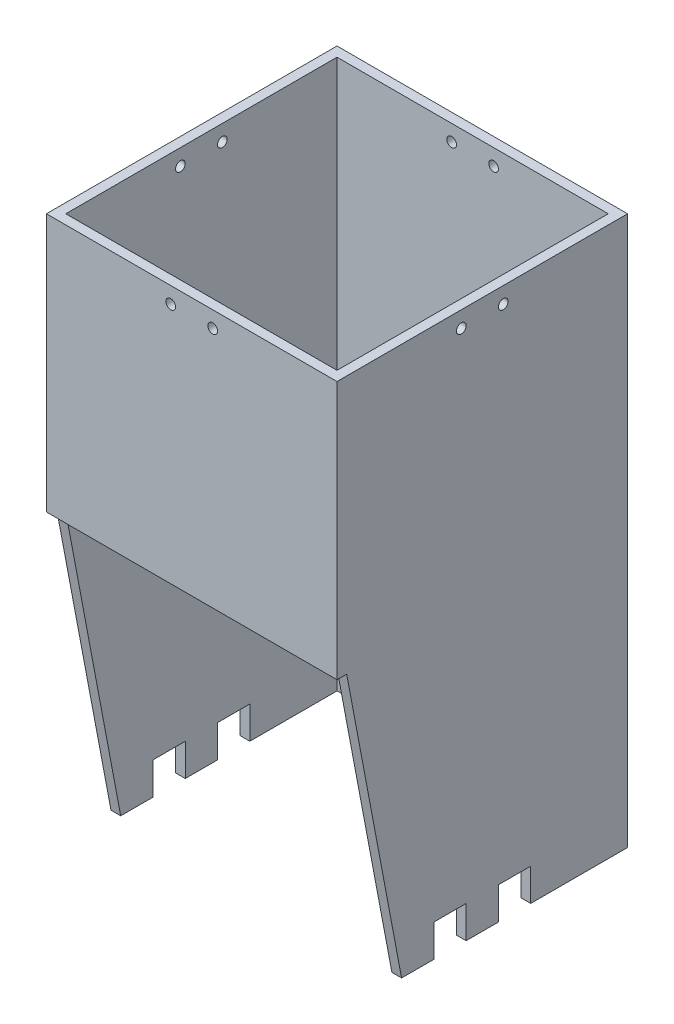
ISO-10303-21;
HEADER;
FILE_DESCRIPTION(('STEP AP214'),'2;1');
FILE_NAME('part.step','',(''),(''),'','','');
FILE_SCHEMA(('AUTOMOTIVE_DESIGN { 1 0 10303 214 1 1 1 1 }'));
ENDSEC;
DATA;
#1=APPLICATION_CONTEXT('core data for automotive mechanical design processes');
#2=APPLICATION_PROTOCOL_DEFINITION('international standard','automotive_design',2000,#1);
#3=PRODUCT_CONTEXT('',#1,'mechanical');
#4=PRODUCT('Part','Part','',(#3));
#5=PRODUCT_RELATED_PRODUCT_CATEGORY('part','',(#4));
#6=PRODUCT_DEFINITION_FORMATION('','',#4);
#7=PRODUCT_DEFINITION_CONTEXT('part definition',#1,'design');
#8=PRODUCT_DEFINITION('design','',#6,#7);
#9=PRODUCT_DEFINITION_SHAPE('','',#8);
#10=(LENGTH_UNIT() NAMED_UNIT(*) SI_UNIT(.MILLI.,.METRE.));
#11=(NAMED_UNIT(*) PLANE_ANGLE_UNIT() SI_UNIT($,.RADIAN.));
#12=(NAMED_UNIT(*) SI_UNIT($,.STERADIAN.) SOLID_ANGLE_UNIT());
#13=UNCERTAINTY_MEASURE_WITH_UNIT(LENGTH_MEASURE(1.E-05),#10,'distance_accuracy_value','');
#14=(GEOMETRIC_REPRESENTATION_CONTEXT(3) GLOBAL_UNCERTAINTY_ASSIGNED_CONTEXT((#13)) GLOBAL_UNIT_ASSIGNED_CONTEXT((#10,
#11,#12)) REPRESENTATION_CONTEXT('',''));
#15=CARTESIAN_POINT('',(0.,0.,0.));
#16=DIRECTION('',(0.,0.,1.));
#17=DIRECTION('',(1.,0.,0.));
#18=AXIS2_PLACEMENT_3D('',#15,#16,#17);
#19=CARTESIAN_POINT('',(0.,0.,0.));
#20=DIRECTION('',(0.,-1.,0.));
#21=DIRECTION('',(0.,0.,-1.));
#22=AXIS2_PLACEMENT_3D('',#19,#20,#21);
#23=PLANE('',#22);
#24=DIRECTION('',(1.,0.,0.));
#25=VECTOR('',#24,1.);
#26=CARTESIAN_POINT('',(-137.195444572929,0.,25.));
#27=LINE('',#26,#25);
#28=CARTESIAN_POINT('',(-45.,0.,25.));
#29=VERTEX_POINT('',#28);
#30=CARTESIAN_POINT('',(-42.,0.,25.));
#31=VERTEX_POINT('',#30);
#32=EDGE_CURVE('E521',#29,#31,#27,.T.);
#33=ORIENTED_EDGE('',*,*,#32,.F.);
#34=DIRECTION('',(0.,0.,1.));
#35=VECTOR('',#34,1.);
#36=CARTESIAN_POINT('',(-45.,0.,45.));
#37=LINE('',#36,#35);
#38=CARTESIAN_POINT('',(-45.,0.,15.));
#39=VERTEX_POINT('',#38);
#40=EDGE_CURVE('E337',#39,#29,#37,.T.);
#41=ORIENTED_EDGE('',*,*,#40,.F.);
#42=DIRECTION('',(1.,0.,0.));
#43=VECTOR('',#42,1.);
#44=CARTESIAN_POINT('',(-59.1421356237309,0.,15.));
#45=LINE('',#44,#43);
#46=CARTESIAN_POINT('',(-42.,0.,15.));
#47=VERTEX_POINT('',#46);
#48=EDGE_CURVE('E302',#39,#47,#45,.T.);
#49=ORIENTED_EDGE('',*,*,#48,.T.);
#50=DIRECTION('',(0.,0.,1.));
#51=VECTOR('',#50,1.);
#52=CARTESIAN_POINT('',(-42.,0.,-42.));
#53=LINE('',#52,#51);
#54=EDGE_CURVE('E418',#47,#31,#53,.T.);
#55=ORIENTED_EDGE('',*,*,#54,.T.);
#56=EDGE_LOOP('',(#33,#41,#49,#55));
#57=FACE_BOUND('',#56,.T.);
#58=ADVANCED_FACE('F33',(#57),#23,.T.);
#59=DIRECTION('',(1.,0.,0.));
#60=VECTOR('',#59,1.);
#61=CARTESIAN_POINT('',(-59.1421356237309,0.,4.99999999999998));
#62=LINE('',#61,#60);
#63=CARTESIAN_POINT('',(42.,0.,4.99999999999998));
#64=VERTEX_POINT('',#63);
#65=CARTESIAN_POINT('',(45.,0.,4.99999999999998));
#66=VERTEX_POINT('',#65);
#67=EDGE_CURVE('E288',#64,#66,#62,.T.);
#68=ORIENTED_EDGE('',*,*,#67,.F.);
#69=DIRECTION('',(0.,0.,-1.));
#70=VECTOR('',#69,1.);
#71=CARTESIAN_POINT('',(42.,0.,42.));
#72=LINE('',#71,#70);
#73=CARTESIAN_POINT('',(42.,0.,-5.));
#74=VERTEX_POINT('',#73);
#75=EDGE_CURVE('E298',#64,#74,#72,.T.);
#76=ORIENTED_EDGE('',*,*,#75,.T.);
#77=DIRECTION('',(1.,0.,0.));
#78=VECTOR('',#77,1.);
#79=CARTESIAN_POINT('',(-59.1421356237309,0.,-5.));
#80=LINE('',#79,#78);
#81=CARTESIAN_POINT('',(45.,0.,-5.));
#82=VERTEX_POINT('',#81);
#83=EDGE_CURVE('E375',#74,#82,#80,.T.);
#84=ORIENTED_EDGE('',*,*,#83,.T.);
#85=DIRECTION('',(0.,0.,-1.));
#86=VECTOR('',#85,1.);
#87=CARTESIAN_POINT('',(45.,0.,45.));
#88=LINE('',#87,#86);
#89=EDGE_CURVE('E300',#66,#82,#88,.T.);
#90=ORIENTED_EDGE('',*,*,#89,.F.);
#91=EDGE_LOOP('',(#68,#76,#84,#90));
#92=FACE_BOUND('',#91,.T.);
#93=ADVANCED_FACE('F296',(#92),#23,.T.);
#94=CARTESIAN_POINT('',(-45.,0.,4.99999999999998));
#95=VERTEX_POINT('',#94);
#96=CARTESIAN_POINT('',(-42.,0.,4.99999999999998));
#97=VERTEX_POINT('',#96);
#98=EDGE_CURVE('E301',#95,#97,#62,.T.);
#99=ORIENTED_EDGE('',*,*,#98,.F.);
#100=CARTESIAN_POINT('',(-45.,0.,-5.));
#101=VERTEX_POINT('',#100);
#102=EDGE_CURVE('E342',#101,#95,#37,.T.);
#103=ORIENTED_EDGE('',*,*,#102,.F.);
#104=CARTESIAN_POINT('',(-42.,0.,-5.));
#105=VERTEX_POINT('',#104);
#106=EDGE_CURVE('E370',#101,#105,#80,.T.);
#107=ORIENTED_EDGE('',*,*,#106,.T.);
#108=EDGE_CURVE('E421',#105,#97,#53,.T.);
#109=ORIENTED_EDGE('',*,*,#108,.T.);
#110=EDGE_LOOP('',(#99,#103,#107,#109));
#111=FACE_BOUND('',#110,.T.);
#112=ADVANCED_FACE('F430',(#111),#23,.T.);
#113=CARTESIAN_POINT('',(42.,0.,25.));
#114=VERTEX_POINT('',#113);
#115=CARTESIAN_POINT('',(45.,0.,25.));
#116=VERTEX_POINT('',#115);
#117=EDGE_CURVE('E231',#114,#116,#27,.T.);
#118=ORIENTED_EDGE('',*,*,#117,.F.);
#119=CARTESIAN_POINT('',(42.,0.,15.));
#120=VERTEX_POINT('',#119);
#121=EDGE_CURVE('E309',#114,#120,#72,.T.);
#122=ORIENTED_EDGE('',*,*,#121,.T.);
#123=CARTESIAN_POINT('',(45.,0.,15.));
#124=VERTEX_POINT('',#123);
#125=EDGE_CURVE('E528',#120,#124,#45,.T.);
#126=ORIENTED_EDGE('',*,*,#125,.T.);
#127=EDGE_CURVE('E335',#116,#124,#88,.T.);
#128=ORIENTED_EDGE('',*,*,#127,.F.);
#129=EDGE_LOOP('',(#118,#122,#126,#128));
#130=FACE_BOUND('',#129,.T.);
#131=ADVANCED_FACE('F502',(#130),#23,.T.);
#132=CARTESIAN_POINT('',(0.,170.,0.));
#133=DIRECTION('',(0.,-1.,0.));
#134=DIRECTION('',(0.,0.,-1.));
#135=AXIS2_PLACEMENT_3D('',#132,#133,#134);
#136=PLANE('',#135);
#137=DIRECTION('',(0.,0.,-1.));
#138=VECTOR('',#137,1.);
#139=CARTESIAN_POINT('',(45.,170.,45.));
#140=LINE('',#139,#138);
#141=CARTESIAN_POINT('',(45.,170.,45.));
#142=VERTEX_POINT('',#141);
#143=CARTESIAN_POINT('',(45.,170.,-45.));
#144=VERTEX_POINT('',#143);
#145=EDGE_CURVE('E235',#142,#144,#140,.T.);
#146=ORIENTED_EDGE('',*,*,#145,.T.);
#147=DIRECTION('',(-1.,0.,0.));
#148=VECTOR('',#147,1.);
#149=CARTESIAN_POINT('',(-45.,170.,-45.));
#150=LINE('',#149,#148);
#151=CARTESIAN_POINT('',(-45.,170.,-45.));
#152=VERTEX_POINT('',#151);
#153=EDGE_CURVE('E332',#144,#152,#150,.T.);
#154=ORIENTED_EDGE('',*,*,#153,.T.);
#155=DIRECTION('',(0.,0.,1.));
#156=VECTOR('',#155,1.);
#157=CARTESIAN_POINT('',(-45.,170.,45.));
#158=LINE('',#157,#156);
#159=CARTESIAN_POINT('',(-45.,170.,45.));
#160=VERTEX_POINT('',#159);
#161=EDGE_CURVE('E240',#152,#160,#158,.T.);
#162=ORIENTED_EDGE('',*,*,#161,.T.);
#163=DIRECTION('',(1.,0.,0.));
#164=VECTOR('',#163,1.);
#165=CARTESIAN_POINT('',(-45.,170.,45.));
#166=LINE('',#165,#164);
#167=EDGE_CURVE('E236',#160,#142,#166,.T.);
#168=ORIENTED_EDGE('',*,*,#167,.T.);
#169=EDGE_LOOP('',(#146,#154,#162,#168));
#170=FACE_BOUND('',#169,.T.);
#171=DIRECTION('',(-1.,0.,0.));
#172=VECTOR('',#171,1.);
#173=CARTESIAN_POINT('',(42.,170.,-42.));
#174=LINE('',#173,#172);
#175=CARTESIAN_POINT('',(42.,170.,-42.));
#176=VERTEX_POINT('',#175);
#177=CARTESIAN_POINT('',(-42.,170.,-42.));
#178=VERTEX_POINT('',#177);
#179=EDGE_CURVE('E312',#176,#178,#174,.T.);
#180=ORIENTED_EDGE('',*,*,#179,.F.);
#181=DIRECTION('',(0.,0.,-1.));
#182=VECTOR('',#181,1.);
#183=CARTESIAN_POINT('',(42.,170.,42.));
#184=LINE('',#183,#182);
#185=CARTESIAN_POINT('',(42.,170.,42.));
#186=VERTEX_POINT('',#185);
#187=EDGE_CURVE('E321',#186,#176,#184,.T.);
#188=ORIENTED_EDGE('',*,*,#187,.F.);
#189=DIRECTION('',(1.,0.,0.));
#190=VECTOR('',#189,1.);
#191=CARTESIAN_POINT('',(-42.,170.,42.));
#192=LINE('',#191,#190);
#193=CARTESIAN_POINT('',(-42.,170.,42.));
#194=VERTEX_POINT('',#193);
#195=EDGE_CURVE('E415',#194,#186,#192,.T.);
#196=ORIENTED_EDGE('',*,*,#195,.F.);
#197=DIRECTION('',(0.,0.,1.));
#198=VECTOR('',#197,1.);
#199=CARTESIAN_POINT('',(-42.,170.,-42.));
#200=LINE('',#199,#198);
#201=EDGE_CURVE('E413',#178,#194,#200,.T.);
#202=ORIENTED_EDGE('',*,*,#201,.F.);
#203=EDGE_LOOP('',(#180,#188,#196,#202));
#204=FACE_BOUND('',#203,.T.);
#205=ADVANCED_FACE('F501',(#170,#204),#136,.F.);
#206=DIRECTION('',(1.,0.,0.));
#207=VECTOR('',#206,1.);
#208=CARTESIAN_POINT('',(-59.1421356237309,0.,-15.));
#209=LINE('',#208,#207);
#210=CARTESIAN_POINT('',(-45.,0.,-15.));
#211=VERTEX_POINT('',#210);
#212=CARTESIAN_POINT('',(-42.,0.,-15.));
#213=VERTEX_POINT('',#212);
#214=EDGE_CURVE('E361',#211,#213,#209,.T.);
#215=ORIENTED_EDGE('',*,*,#214,.F.);
#216=CARTESIAN_POINT('',(-45.,0.,-45.));
#217=VERTEX_POINT('',#216);
#218=EDGE_CURVE('E243',#217,#211,#37,.T.);
#219=ORIENTED_EDGE('',*,*,#218,.F.);
#220=DIRECTION('',(-1.,0.,0.));
#221=VECTOR('',#220,1.);
#222=CARTESIAN_POINT('',(-45.,0.,-45.));
#223=LINE('',#222,#221);
#224=CARTESIAN_POINT('',(45.,0.,-45.));
#225=VERTEX_POINT('',#224);
#226=EDGE_CURVE('E336',#225,#217,#223,.T.);
#227=ORIENTED_EDGE('',*,*,#226,.F.);
#228=CARTESIAN_POINT('',(45.,0.,-15.));
#229=VERTEX_POINT('',#228);
#230=EDGE_CURVE('E330',#229,#225,#88,.T.);
#231=ORIENTED_EDGE('',*,*,#230,.F.);
#232=CARTESIAN_POINT('',(42.,0.,-15.));
#233=VERTEX_POINT('',#232);
#234=EDGE_CURVE('E366',#233,#229,#209,.T.);
#235=ORIENTED_EDGE('',*,*,#234,.F.);
#236=CARTESIAN_POINT('',(42.,0.,-42.));
#237=VERTEX_POINT('',#236);
#238=EDGE_CURVE('E310',#233,#237,#72,.T.);
#239=ORIENTED_EDGE('',*,*,#238,.T.);
#240=DIRECTION('',(-1.,0.,0.));
#241=VECTOR('',#240,1.);
#242=CARTESIAN_POINT('',(42.,0.,-42.));
#243=LINE('',#242,#241);
#244=CARTESIAN_POINT('',(-42.,0.,-42.));
#245=VERTEX_POINT('',#244);
#246=EDGE_CURVE('E411',#237,#245,#243,.T.);
#247=ORIENTED_EDGE('',*,*,#246,.T.);
#248=EDGE_CURVE('E313',#245,#213,#53,.T.);
#249=ORIENTED_EDGE('',*,*,#248,.T.);
#250=EDGE_LOOP('',(#215,#219,#227,#231,#235,#239,#247,#249));
#251=FACE_BOUND('',#250,.T.);
#252=ADVANCED_FACE('F358',(#251),#23,.T.);
#253=CARTESIAN_POINT('',(45.,170.,45.));
#254=DIRECTION('',(-1.,0.,0.));
#255=DIRECTION('',(0.,0.,1.));
#256=AXIS2_PLACEMENT_3D('',#253,#254,#255);
#257=PLANE('',#256);
#258=CARTESIAN_POINT('',(45.,165.,6.49999999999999));
#259=DIRECTION('',(1.,0.,0.));
#260=DIRECTION('',(0.,0.,-1.));
#261=AXIS2_PLACEMENT_3D('',#258,#259,#260);
#262=CIRCLE('',#261,1.5);
#263=CARTESIAN_POINT('',(45.,165.,4.99999999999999));
#264=VERTEX_POINT('',#263);
#265=EDGE_CURVE('E383',#264,#264,#262,.T.);
#266=ORIENTED_EDGE('',*,*,#265,.F.);
#267=EDGE_LOOP('',(#266));
#268=FACE_BOUND('',#267,.T.);
#269=CARTESIAN_POINT('',(45.,165.,-6.50000000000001));
#270=DIRECTION('',(1.,0.,0.));
#271=DIRECTION('',(0.,0.,-1.));
#272=AXIS2_PLACEMENT_3D('',#269,#270,#271);
#273=CIRCLE('',#272,1.5);
#274=CARTESIAN_POINT('',(45.,165.,-8.00000000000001));
#275=VERTEX_POINT('',#274);
#276=EDGE_CURVE('E390',#275,#275,#273,.T.);
#277=ORIENTED_EDGE('',*,*,#276,.F.);
#278=EDGE_LOOP('',(#277));
#279=FACE_BOUND('',#278,.T.);
#280=DIRECTION('',(0.,-1.,0.));
#281=VECTOR('',#280,1.);
#282=CARTESIAN_POINT('',(45.,170.,45.));
#283=LINE('',#282,#281);
#284=CARTESIAN_POINT('',(45.,90.,45.));
#285=VERTEX_POINT('',#284);
#286=EDGE_CURVE('E227',#142,#285,#283,.T.);
#287=ORIENTED_EDGE('',*,*,#286,.T.);
#288=DIRECTION('',(0.,0.,1.));
#289=VECTOR('',#288,1.);
#290=CARTESIAN_POINT('',(45.,90.,45.));
#291=LINE('',#290,#289);
#292=CARTESIAN_POINT('',(45.,90.,42.));
#293=VERTEX_POINT('',#292);
#294=EDGE_CURVE('E210',#293,#285,#291,.T.);
#295=ORIENTED_EDGE('',*,*,#294,.F.);
#296=DIRECTION('',(0.,0.982624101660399,0.185606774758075));
#297=VECTOR('',#296,1.);
#298=CARTESIAN_POINT('',(45.,90.,42.));
#299=LINE('',#298,#297);
#300=EDGE_CURVE('E220',#116,#293,#299,.T.);
#301=ORIENTED_EDGE('',*,*,#300,.F.);
#302=ORIENTED_EDGE('',*,*,#127,.T.);
#303=DIRECTION('',(0.,-1.,0.));
#304=VECTOR('',#303,1.);
#305=CARTESIAN_POINT('',(45.,0.,15.));
#306=LINE('',#305,#304);
#307=CARTESIAN_POINT('',(45.,10.,15.));
#308=VERTEX_POINT('',#307);
#309=EDGE_CURVE('E530',#308,#124,#306,.T.);
#310=ORIENTED_EDGE('',*,*,#309,.F.);
#311=DIRECTION('',(0.,0.,1.));
#312=VECTOR('',#311,1.);
#313=CARTESIAN_POINT('',(45.,10.,4.99999999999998));
#314=LINE('',#313,#312);
#315=CARTESIAN_POINT('',(45.,10.,4.99999999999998));
#316=VERTEX_POINT('',#315);
#317=EDGE_CURVE('E552',#316,#308,#314,.T.);
#318=ORIENTED_EDGE('',*,*,#317,.F.);
#319=DIRECTION('',(0.,1.,0.));
#320=VECTOR('',#319,1.);
#321=CARTESIAN_POINT('',(45.,0.,4.99999999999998));
#322=LINE('',#321,#320);
#323=EDGE_CURVE('E549',#66,#316,#322,.T.);
#324=ORIENTED_EDGE('',*,*,#323,.F.);
#325=ORIENTED_EDGE('',*,*,#89,.T.);
#326=DIRECTION('',(0.,-1.,0.));
#327=VECTOR('',#326,1.);
#328=CARTESIAN_POINT('',(45.,0.,-5.));
#329=LINE('',#328,#327);
#330=CARTESIAN_POINT('',(45.,10.,-5.));
#331=VERTEX_POINT('',#330);
#332=EDGE_CURVE('E444',#331,#82,#329,.T.);
#333=ORIENTED_EDGE('',*,*,#332,.F.);
#334=DIRECTION('',(0.,0.,1.));
#335=VECTOR('',#334,1.);
#336=CARTESIAN_POINT('',(45.,10.,-5.));
#337=LINE('',#336,#335);
#338=CARTESIAN_POINT('',(45.,10.,-15.));
#339=VERTEX_POINT('',#338);
#340=EDGE_CURVE('E460',#339,#331,#337,.T.);
#341=ORIENTED_EDGE('',*,*,#340,.F.);
#342=DIRECTION('',(0.,1.,0.));
#343=VECTOR('',#342,1.);
#344=CARTESIAN_POINT('',(45.,0.,-15.));
#345=LINE('',#344,#343);
#346=EDGE_CURVE('E448',#229,#339,#345,.T.);
#347=ORIENTED_EDGE('',*,*,#346,.F.);
#348=ORIENTED_EDGE('',*,*,#230,.T.);
#349=DIRECTION('',(0.,-1.,0.));
#350=VECTOR('',#349,1.);
#351=CARTESIAN_POINT('',(45.,170.,-45.));
#352=LINE('',#351,#350);
#353=EDGE_CURVE('E248',#144,#225,#352,.T.);
#354=ORIENTED_EDGE('',*,*,#353,.F.);
#355=ORIENTED_EDGE('',*,*,#145,.F.);
#356=EDGE_LOOP('',(#287,#295,#301,#302,#310,#318,#324,#325,#333,#341,#347,#348,#354,#355));
#357=FACE_BOUND('',#356,.T.);
#358=ADVANCED_FACE('F35',(#268,#279,#357),#257,.F.);
#359=CARTESIAN_POINT('',(-45.,170.,-45.));
#360=DIRECTION('',(0.,0.,1.));
#361=DIRECTION('',(1.,0.,0.));
#362=AXIS2_PLACEMENT_3D('',#359,#360,#361);
#363=PLANE('',#362);
#364=CARTESIAN_POINT('',(-6.49999999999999,165.,-45.));
#365=DIRECTION('',(0.,0.,1.));
#366=DIRECTION('',(1.,0.,0.));
#367=AXIS2_PLACEMENT_3D('',#364,#365,#366);
#368=CIRCLE('',#367,1.50000000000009);
#369=CARTESIAN_POINT('',(-4.9999999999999,165.,-45.));
#370=VERTEX_POINT('',#369);
#371=EDGE_CURVE('E261',#370,#370,#368,.F.);
#372=ORIENTED_EDGE('',*,*,#371,.F.);
#373=EDGE_LOOP('',(#372));
#374=FACE_BOUND('',#373,.T.);
#375=CARTESIAN_POINT('',(6.50000000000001,165.,-45.));
#376=DIRECTION('',(0.,0.,1.));
#377=DIRECTION('',(1.,0.,0.));
#378=AXIS2_PLACEMENT_3D('',#375,#376,#377);
#379=CIRCLE('',#378,1.50000000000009);
#380=CARTESIAN_POINT('',(8.00000000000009,165.,-45.));
#381=VERTEX_POINT('',#380);
#382=EDGE_CURVE('E256',#381,#381,#379,.F.);
#383=ORIENTED_EDGE('',*,*,#382,.F.);
#384=EDGE_LOOP('',(#383));
#385=FACE_BOUND('',#384,.T.);
#386=ORIENTED_EDGE('',*,*,#226,.T.);
#387=DIRECTION('',(0.,-1.,0.));
#388=VECTOR('',#387,1.);
#389=CARTESIAN_POINT('',(-45.,170.,-45.));
#390=LINE('',#389,#388);
#391=EDGE_CURVE('E238',#152,#217,#390,.T.);
#392=ORIENTED_EDGE('',*,*,#391,.F.);
#393=ORIENTED_EDGE('',*,*,#153,.F.);
#394=ORIENTED_EDGE('',*,*,#353,.T.);
#395=EDGE_LOOP('',(#386,#392,#393,#394));
#396=FACE_BOUND('',#395,.T.);
#397=ADVANCED_FACE('F507',(#374,#385,#396),#363,.F.);
#398=CARTESIAN_POINT('',(-45.,170.,45.));
#399=DIRECTION('',(1.,0.,0.));
#400=DIRECTION('',(0.,0.,-1.));
#401=AXIS2_PLACEMENT_3D('',#398,#399,#400);
#402=PLANE('',#401);
#403=DIRECTION('',(0.,-0.982624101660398,-0.185606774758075));
#404=VECTOR('',#403,1.);
#405=CARTESIAN_POINT('',(-45.,90.,42.));
#406=LINE('',#405,#404);
#407=CARTESIAN_POINT('',(-45.,90.,42.));
#408=VERTEX_POINT('',#407);
#409=EDGE_CURVE('E554',#408,#29,#406,.T.);
#410=ORIENTED_EDGE('',*,*,#409,.F.);
#411=DIRECTION('',(0.,0.,-1.));
#412=VECTOR('',#411,1.);
#413=CARTESIAN_POINT('',(-45.,90.,45.));
#414=LINE('',#413,#412);
#415=CARTESIAN_POINT('',(-45.,90.,45.));
#416=VERTEX_POINT('',#415);
#417=EDGE_CURVE('E550',#416,#408,#414,.T.);
#418=ORIENTED_EDGE('',*,*,#417,.F.);
#419=DIRECTION('',(0.,-1.,0.));
#420=VECTOR('',#419,1.);
#421=CARTESIAN_POINT('',(-45.,170.,45.));
#422=LINE('',#421,#420);
#423=EDGE_CURVE('E230',#160,#416,#422,.T.);
#424=ORIENTED_EDGE('',*,*,#423,.F.);
#425=ORIENTED_EDGE('',*,*,#161,.F.);
#426=ORIENTED_EDGE('',*,*,#391,.T.);
#427=ORIENTED_EDGE('',*,*,#218,.T.);
#428=DIRECTION('',(0.,-1.,0.));
#429=VECTOR('',#428,1.);
#430=CARTESIAN_POINT('',(-45.,0.,-15.));
#431=LINE('',#430,#429);
#432=CARTESIAN_POINT('',(-45.,10.,-15.));
#433=VERTEX_POINT('',#432);
#434=EDGE_CURVE('E354',#433,#211,#431,.T.);
#435=ORIENTED_EDGE('',*,*,#434,.F.);
#436=DIRECTION('',(0.,0.,-1.));
#437=VECTOR('',#436,1.);
#438=CARTESIAN_POINT('',(-45.,10.,-5.));
#439=LINE('',#438,#437);
#440=CARTESIAN_POINT('',(-45.,10.,-5.));
#441=VERTEX_POINT('',#440);
#442=EDGE_CURVE('E454',#441,#433,#439,.T.);
#443=ORIENTED_EDGE('',*,*,#442,.F.);
#444=DIRECTION('',(0.,1.,0.));
#445=VECTOR('',#444,1.);
#446=CARTESIAN_POINT('',(-45.,0.,-5.));
#447=LINE('',#446,#445);
#448=EDGE_CURVE('E379',#101,#441,#447,.T.);
#449=ORIENTED_EDGE('',*,*,#448,.F.);
#450=ORIENTED_EDGE('',*,*,#102,.T.);
#451=DIRECTION('',(0.,-1.,0.));
#452=VECTOR('',#451,1.);
#453=CARTESIAN_POINT('',(-45.,0.,4.99999999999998));
#454=LINE('',#453,#452);
#455=CARTESIAN_POINT('',(-45.,10.,4.99999999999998));
#456=VERTEX_POINT('',#455);
#457=EDGE_CURVE('E539',#456,#95,#454,.T.);
#458=ORIENTED_EDGE('',*,*,#457,.F.);
#459=DIRECTION('',(0.,0.,-1.));
#460=VECTOR('',#459,1.);
#461=CARTESIAN_POINT('',(-45.,10.,4.99999999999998));
#462=LINE('',#461,#460);
#463=CARTESIAN_POINT('',(-45.,10.,15.));
#464=VERTEX_POINT('',#463);
#465=EDGE_CURVE('E538',#464,#456,#462,.T.);
#466=ORIENTED_EDGE('',*,*,#465,.F.);
#467=DIRECTION('',(0.,1.,0.));
#468=VECTOR('',#467,1.);
#469=CARTESIAN_POINT('',(-45.,0.,15.));
#470=LINE('',#469,#468);
#471=EDGE_CURVE('E544',#39,#464,#470,.T.);
#472=ORIENTED_EDGE('',*,*,#471,.F.);
#473=ORIENTED_EDGE('',*,*,#40,.T.);
#474=EDGE_LOOP('',(#410,#418,#424,#425,#426,#427,#435,#443,#449,#450,#458,#466,#472,#473));
#475=FACE_BOUND('',#474,.T.);
#476=CARTESIAN_POINT('',(-45.,165.,6.49999999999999));
#477=DIRECTION('',(1.,0.,0.));
#478=DIRECTION('',(0.,0.,-1.));
#479=AXIS2_PLACEMENT_3D('',#476,#477,#478);
#480=CIRCLE('',#479,1.5);
#481=CARTESIAN_POINT('',(-45.,165.,4.99999999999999));
#482=VERTEX_POINT('',#481);
#483=EDGE_CURVE('E271',#482,#482,#480,.F.);
#484=ORIENTED_EDGE('',*,*,#483,.F.);
#485=EDGE_LOOP('',(#484));
#486=FACE_BOUND('',#485,.T.);
#487=CARTESIAN_POINT('',(-45.,165.,-6.50000000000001));
#488=DIRECTION('',(1.,0.,0.));
#489=DIRECTION('',(0.,0.,-1.));
#490=AXIS2_PLACEMENT_3D('',#487,#488,#489);
#491=CIRCLE('',#490,1.5);
#492=CARTESIAN_POINT('',(-45.,165.,-8.00000000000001));
#493=VERTEX_POINT('',#492);
#494=EDGE_CURVE('E266',#493,#493,#491,.F.);
#495=ORIENTED_EDGE('',*,*,#494,.F.);
#496=EDGE_LOOP('',(#495));
#497=FACE_BOUND('',#496,.T.);
#498=ADVANCED_FACE('F351',(#475,#486,#497),#402,.F.);
#499=CARTESIAN_POINT('',(-45.,170.,45.));
#500=DIRECTION('',(0.,0.,-1.));
#501=DIRECTION('',(-1.,0.,0.));
#502=AXIS2_PLACEMENT_3D('',#499,#500,#501);
#503=PLANE('',#502);
#504=CARTESIAN_POINT('',(-6.49999999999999,165.,45.));
#505=DIRECTION('',(0.,0.,1.));
#506=DIRECTION('',(1.,0.,0.));
#507=AXIS2_PLACEMENT_3D('',#504,#505,#506);
#508=CIRCLE('',#507,1.50000000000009);
#509=CARTESIAN_POINT('',(-4.9999999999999,165.,45.));
#510=VERTEX_POINT('',#509);
#511=EDGE_CURVE('E397',#510,#510,#508,.T.);
#512=ORIENTED_EDGE('',*,*,#511,.F.);
#513=EDGE_LOOP('',(#512));
#514=FACE_BOUND('',#513,.T.);
#515=CARTESIAN_POINT('',(6.50000000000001,165.,45.));
#516=DIRECTION('',(0.,0.,1.));
#517=DIRECTION('',(1.,0.,0.));
#518=AXIS2_PLACEMENT_3D('',#515,#516,#517);
#519=CIRCLE('',#518,1.50000000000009);
#520=CARTESIAN_POINT('',(8.00000000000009,165.,45.));
#521=VERTEX_POINT('',#520);
#522=EDGE_CURVE('E404',#521,#521,#519,.T.);
#523=ORIENTED_EDGE('',*,*,#522,.F.);
#524=EDGE_LOOP('',(#523));
#525=FACE_BOUND('',#524,.T.);
#526=ORIENTED_EDGE('',*,*,#423,.T.);
#527=DIRECTION('',(1.,0.,0.));
#528=VECTOR('',#527,1.);
#529=CARTESIAN_POINT('',(-137.195444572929,90.,45.));
#530=LINE('',#529,#528);
#531=EDGE_CURVE('E213',#416,#285,#530,.T.);
#532=ORIENTED_EDGE('',*,*,#531,.T.);
#533=ORIENTED_EDGE('',*,*,#286,.F.);
#534=ORIENTED_EDGE('',*,*,#167,.F.);
#535=EDGE_LOOP('',(#526,#532,#533,#534));
#536=FACE_BOUND('',#535,.T.);
#537=ADVANCED_FACE('F225',(#514,#525,#536),#503,.F.);
#538=CARTESIAN_POINT('',(42.,170.,-42.));
#539=DIRECTION('',(0.,0.,1.));
#540=DIRECTION('',(1.,0.,0.));
#541=AXIS2_PLACEMENT_3D('',#538,#539,#540);
#542=PLANE('',#541);
#543=CARTESIAN_POINT('',(-6.49999999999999,165.,-42.));
#544=DIRECTION('',(0.,0.,1.));
#545=DIRECTION('',(1.,0.,0.));
#546=AXIS2_PLACEMENT_3D('',#543,#544,#545);
#547=CIRCLE('',#546,1.50000000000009);
#548=CARTESIAN_POINT('',(-4.9999999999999,165.,-42.));
#549=VERTEX_POINT('',#548);
#550=EDGE_CURVE('E260',#549,#549,#547,.T.);
#551=ORIENTED_EDGE('',*,*,#550,.F.);
#552=EDGE_LOOP('',(#551));
#553=FACE_BOUND('',#552,.T.);
#554=CARTESIAN_POINT('',(6.50000000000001,165.,-42.));
#555=DIRECTION('',(0.,0.,1.));
#556=DIRECTION('',(1.,0.,0.));
#557=AXIS2_PLACEMENT_3D('',#554,#555,#556);
#558=CIRCLE('',#557,1.50000000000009);
#559=CARTESIAN_POINT('',(8.00000000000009,165.,-42.));
#560=VERTEX_POINT('',#559);
#561=EDGE_CURVE('E255',#560,#560,#558,.T.);
#562=ORIENTED_EDGE('',*,*,#561,.F.);
#563=EDGE_LOOP('',(#562));
#564=FACE_BOUND('',#563,.T.);
#565=ORIENTED_EDGE('',*,*,#246,.F.);
#566=DIRECTION('',(0.,-1.,0.));
#567=VECTOR('',#566,1.);
#568=CARTESIAN_POINT('',(42.,170.,-42.));
#569=LINE('',#568,#567);
#570=EDGE_CURVE('E317',#176,#237,#569,.T.);
#571=ORIENTED_EDGE('',*,*,#570,.F.);
#572=ORIENTED_EDGE('',*,*,#179,.T.);
#573=DIRECTION('',(0.,-1.,0.));
#574=VECTOR('',#573,1.);
#575=CARTESIAN_POINT('',(-42.,170.,-42.));
#576=LINE('',#575,#574);
#577=EDGE_CURVE('E327',#178,#245,#576,.T.);
#578=ORIENTED_EDGE('',*,*,#577,.T.);
#579=EDGE_LOOP('',(#565,#571,#572,#578));
#580=FACE_BOUND('',#579,.T.);
#581=ADVANCED_FACE('F594',(#553,#564,#580),#542,.T.);
#582=CARTESIAN_POINT('',(-42.,170.,-42.));
#583=DIRECTION('',(1.,0.,0.));
#584=DIRECTION('',(0.,0.,-1.));
#585=AXIS2_PLACEMENT_3D('',#582,#583,#584);
#586=PLANE('',#585);
#587=DIRECTION('',(0.,0.982624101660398,0.185606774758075));
#588=VECTOR('',#587,1.);
#589=CARTESIAN_POINT('',(-42.,151.923948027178,53.6967457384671));
#590=LINE('',#589,#588);
#591=CARTESIAN_POINT('',(-42.,90.,42.));
#592=VERTEX_POINT('',#591);
#593=EDGE_CURVE('E545',#31,#592,#590,.T.);
#594=ORIENTED_EDGE('',*,*,#593,.F.);
#595=ORIENTED_EDGE('',*,*,#54,.F.);
#596=DIRECTION('',(0.,-1.,0.));
#597=VECTOR('',#596,1.);
#598=CARTESIAN_POINT('',(-42.,170.,15.));
#599=LINE('',#598,#597);
#600=CARTESIAN_POINT('',(-42.,10.,15.));
#601=VERTEX_POINT('',#600);
#602=EDGE_CURVE('E445',#601,#47,#599,.T.);
#603=ORIENTED_EDGE('',*,*,#602,.F.);
#604=DIRECTION('',(0.,0.,1.));
#605=VECTOR('',#604,1.);
#606=CARTESIAN_POINT('',(-42.,10.,-42.));
#607=LINE('',#606,#605);
#608=CARTESIAN_POINT('',(-42.,10.,4.99999999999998));
#609=VERTEX_POINT('',#608);
#610=EDGE_CURVE('E442',#609,#601,#607,.T.);
#611=ORIENTED_EDGE('',*,*,#610,.F.);
#612=DIRECTION('',(0.,1.,0.));
#613=VECTOR('',#612,1.);
#614=CARTESIAN_POINT('',(-42.,170.,4.99999999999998));
#615=LINE('',#614,#613);
#616=EDGE_CURVE('E440',#97,#609,#615,.T.);
#617=ORIENTED_EDGE('',*,*,#616,.F.);
#618=ORIENTED_EDGE('',*,*,#108,.F.);
#619=DIRECTION('',(0.,-1.,0.));
#620=VECTOR('',#619,1.);
#621=CARTESIAN_POINT('',(-42.,170.,-5.));
#622=LINE('',#621,#620);
#623=CARTESIAN_POINT('',(-42.,10.,-5.));
#624=VERTEX_POINT('',#623);
#625=EDGE_CURVE('E381',#624,#105,#622,.T.);
#626=ORIENTED_EDGE('',*,*,#625,.F.);
#627=DIRECTION('',(0.,0.,1.));
#628=VECTOR('',#627,1.);
#629=CARTESIAN_POINT('',(-42.,10.,-42.));
#630=LINE('',#629,#628);
#631=CARTESIAN_POINT('',(-42.,10.,-15.));
#632=VERTEX_POINT('',#631);
#633=EDGE_CURVE('E378',#632,#624,#630,.T.);
#634=ORIENTED_EDGE('',*,*,#633,.F.);
#635=DIRECTION('',(0.,1.,0.));
#636=VECTOR('',#635,1.);
#637=CARTESIAN_POINT('',(-42.,170.,-15.));
#638=LINE('',#637,#636);
#639=EDGE_CURVE('E376',#213,#632,#638,.T.);
#640=ORIENTED_EDGE('',*,*,#639,.F.);
#641=ORIENTED_EDGE('',*,*,#248,.F.);
#642=ORIENTED_EDGE('',*,*,#577,.F.);
#643=ORIENTED_EDGE('',*,*,#201,.T.);
#644=DIRECTION('',(0.,-1.,0.));
#645=VECTOR('',#644,1.);
#646=CARTESIAN_POINT('',(-42.,170.,42.));
#647=LINE('',#646,#645);
#648=EDGE_CURVE('E324',#194,#592,#647,.T.);
#649=ORIENTED_EDGE('',*,*,#648,.T.);
#650=EDGE_LOOP('',(#594,#595,#603,#611,#617,#618,#626,#634,#640,#641,#642,#643,#649));
#651=FACE_BOUND('',#650,.T.);
#652=CARTESIAN_POINT('',(-42.,165.,6.49999999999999));
#653=DIRECTION('',(1.,0.,0.));
#654=DIRECTION('',(0.,0.,-1.));
#655=AXIS2_PLACEMENT_3D('',#652,#653,#654);
#656=CIRCLE('',#655,1.5);
#657=CARTESIAN_POINT('',(-42.,165.,4.99999999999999));
#658=VERTEX_POINT('',#657);
#659=EDGE_CURVE('E270',#658,#658,#656,.T.);
#660=ORIENTED_EDGE('',*,*,#659,.F.);
#661=EDGE_LOOP('',(#660));
#662=FACE_BOUND('',#661,.T.);
#663=CARTESIAN_POINT('',(-42.,165.,-6.50000000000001));
#664=DIRECTION('',(1.,0.,0.));
#665=DIRECTION('',(0.,0.,-1.));
#666=AXIS2_PLACEMENT_3D('',#663,#664,#665);
#667=CIRCLE('',#666,1.5);
#668=CARTESIAN_POINT('',(-42.,165.,-8.00000000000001));
#669=VERTEX_POINT('',#668);
#670=EDGE_CURVE('E265',#669,#669,#667,.T.);
#671=ORIENTED_EDGE('',*,*,#670,.F.);
#672=EDGE_LOOP('',(#671));
#673=FACE_BOUND('',#672,.T.);
#674=ADVANCED_FACE('F436',(#651,#662,#673),#586,.T.);
#675=CARTESIAN_POINT('',(-42.,170.,42.));
#676=DIRECTION('',(0.,0.,-1.));
#677=DIRECTION('',(-1.,0.,0.));
#678=AXIS2_PLACEMENT_3D('',#675,#676,#677);
#679=PLANE('',#678);
#680=DIRECTION('',(1.,0.,0.));
#681=VECTOR('',#680,1.);
#682=CARTESIAN_POINT('',(-137.195444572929,90.,42.));
#683=LINE('',#682,#681);
#684=CARTESIAN_POINT('',(42.,90.,42.));
#685=VERTEX_POINT('',#684);
#686=EDGE_CURVE('E48',#592,#685,#683,.T.);
#687=ORIENTED_EDGE('',*,*,#686,.F.);
#688=ORIENTED_EDGE('',*,*,#648,.F.);
#689=ORIENTED_EDGE('',*,*,#195,.T.);
#690=DIRECTION('',(0.,-1.,0.));
#691=VECTOR('',#690,1.);
#692=CARTESIAN_POINT('',(42.,170.,42.));
#693=LINE('',#692,#691);
#694=EDGE_CURVE('E320',#186,#685,#693,.T.);
#695=ORIENTED_EDGE('',*,*,#694,.T.);
#696=EDGE_LOOP('',(#687,#688,#689,#695));
#697=FACE_BOUND('',#696,.T.);
#698=CARTESIAN_POINT('',(-6.49999999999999,165.,42.));
#699=DIRECTION('',(0.,0.,-1.));
#700=DIRECTION('',(-1.,0.,0.));
#701=AXIS2_PLACEMENT_3D('',#698,#699,#700);
#702=CIRCLE('',#701,1.50000000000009);
#703=CARTESIAN_POINT('',(-8.00000000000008,165.,42.));
#704=VERTEX_POINT('',#703);
#705=EDGE_CURVE('E257',#704,#704,#702,.T.);
#706=ORIENTED_EDGE('',*,*,#705,.F.);
#707=EDGE_LOOP('',(#706));
#708=FACE_BOUND('',#707,.T.);
#709=CARTESIAN_POINT('',(6.50000000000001,165.,42.));
#710=DIRECTION('',(0.,0.,-1.));
#711=DIRECTION('',(-1.,0.,0.));
#712=AXIS2_PLACEMENT_3D('',#709,#710,#711);
#713=CIRCLE('',#712,1.50000000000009);
#714=CARTESIAN_POINT('',(4.99999999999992,165.,42.));
#715=VERTEX_POINT('',#714);
#716=EDGE_CURVE('E252',#715,#715,#713,.T.);
#717=ORIENTED_EDGE('',*,*,#716,.F.);
#718=EDGE_LOOP('',(#717));
#719=FACE_BOUND('',#718,.T.);
#720=ADVANCED_FACE('F587',(#697,#708,#719),#679,.T.);
#721=CARTESIAN_POINT('',(42.,170.,42.));
#722=DIRECTION('',(-1.,0.,0.));
#723=DIRECTION('',(0.,0.,1.));
#724=AXIS2_PLACEMENT_3D('',#721,#722,#723);
#725=PLANE('',#724);
#726=DIRECTION('',(0.,-0.982624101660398,-0.185606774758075));
#727=VECTOR('',#726,1.);
#728=CARTESIAN_POINT('',(42.,167.244010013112,56.590535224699));
#729=LINE('',#728,#727);
#730=EDGE_CURVE('E11',#685,#114,#729,.T.);
#731=ORIENTED_EDGE('',*,*,#730,.F.);
#732=ORIENTED_EDGE('',*,*,#694,.F.);
#733=ORIENTED_EDGE('',*,*,#187,.T.);
#734=ORIENTED_EDGE('',*,*,#570,.T.);
#735=ORIENTED_EDGE('',*,*,#238,.F.);
#736=DIRECTION('',(0.,-1.,0.));
#737=VECTOR('',#736,1.);
#738=CARTESIAN_POINT('',(42.,170.,-15.));
#739=LINE('',#738,#737);
#740=CARTESIAN_POINT('',(42.,10.,-15.));
#741=VERTEX_POINT('',#740);
#742=EDGE_CURVE('E251',#741,#233,#739,.T.);
#743=ORIENTED_EDGE('',*,*,#742,.F.);
#744=DIRECTION('',(0.,0.,-1.));
#745=VECTOR('',#744,1.);
#746=CARTESIAN_POINT('',(42.,10.,42.));
#747=LINE('',#746,#745);
#748=CARTESIAN_POINT('',(42.,10.,-5.));
#749=VERTEX_POINT('',#748);
#750=EDGE_CURVE('E273',#749,#741,#747,.T.);
#751=ORIENTED_EDGE('',*,*,#750,.F.);
#752=DIRECTION('',(0.,1.,0.));
#753=VECTOR('',#752,1.);
#754=CARTESIAN_POINT('',(42.,170.,-5.));
#755=LINE('',#754,#753);
#756=EDGE_CURVE('E276',#74,#749,#755,.T.);
#757=ORIENTED_EDGE('',*,*,#756,.F.);
#758=ORIENTED_EDGE('',*,*,#75,.F.);
#759=DIRECTION('',(0.,-1.,0.));
#760=VECTOR('',#759,1.);
#761=CARTESIAN_POINT('',(42.,170.,4.99999999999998));
#762=LINE('',#761,#760);
#763=CARTESIAN_POINT('',(42.,10.,4.99999999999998));
#764=VERTEX_POINT('',#763);
#765=EDGE_CURVE('E41',#764,#64,#762,.T.);
#766=ORIENTED_EDGE('',*,*,#765,.F.);
#767=DIRECTION('',(0.,0.,-1.));
#768=VECTOR('',#767,1.);
#769=CARTESIAN_POINT('',(42.,10.,42.));
#770=LINE('',#769,#768);
#771=CARTESIAN_POINT('',(42.,10.,15.));
#772=VERTEX_POINT('',#771);
#773=EDGE_CURVE('E278',#772,#764,#770,.T.);
#774=ORIENTED_EDGE('',*,*,#773,.F.);
#775=DIRECTION('',(0.,1.,0.));
#776=VECTOR('',#775,1.);
#777=CARTESIAN_POINT('',(42.,170.,15.));
#778=LINE('',#777,#776);
#779=EDGE_CURVE('E280',#120,#772,#778,.T.);
#780=ORIENTED_EDGE('',*,*,#779,.F.);
#781=ORIENTED_EDGE('',*,*,#121,.F.);
#782=EDGE_LOOP('',(#731,#732,#733,#734,#735,#743,#751,#757,#758,#766,#774,#780,#781));
#783=FACE_BOUND('',#782,.T.);
#784=CARTESIAN_POINT('',(42.,165.,6.49999999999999));
#785=DIRECTION('',(-1.,0.,0.));
#786=DIRECTION('',(0.,0.,1.));
#787=AXIS2_PLACEMENT_3D('',#784,#785,#786);
#788=CIRCLE('',#787,1.5);
#789=CARTESIAN_POINT('',(42.,165.,7.99999999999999));
#790=VERTEX_POINT('',#789);
#791=EDGE_CURVE('E267',#790,#790,#788,.T.);
#792=ORIENTED_EDGE('',*,*,#791,.F.);
#793=EDGE_LOOP('',(#792));
#794=FACE_BOUND('',#793,.T.);
#795=CARTESIAN_POINT('',(42.,165.,-6.50000000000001));
#796=DIRECTION('',(-1.,0.,0.));
#797=DIRECTION('',(0.,0.,1.));
#798=AXIS2_PLACEMENT_3D('',#795,#796,#797);
#799=CIRCLE('',#798,1.5);
#800=CARTESIAN_POINT('',(42.,165.,-5.));
#801=VERTEX_POINT('',#800);
#802=EDGE_CURVE('E262',#801,#801,#799,.T.);
#803=ORIENTED_EDGE('',*,*,#802,.F.);
#804=EDGE_LOOP('',(#803));
#805=FACE_BOUND('',#804,.T.);
#806=ADVANCED_FACE('F306',(#783,#794,#805),#725,.T.);
#807=CARTESIAN_POINT('',(6.50000000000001,165.,-49.2426406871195));
#808=DIRECTION('',(0.,0.,1.));
#809=DIRECTION('',(1.,0.,0.));
#810=AXIS2_PLACEMENT_3D('',#807,#808,#809);
#811=CYLINDRICAL_SURFACE('',#810,1.50000000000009);
#812=ORIENTED_EDGE('',*,*,#716,.T.);
#813=EDGE_LOOP('',(#812));
#814=FACE_BOUND('',#813,.T.);
#815=ORIENTED_EDGE('',*,*,#522,.T.);
#816=EDGE_LOOP('',(#815));
#817=FACE_BOUND('',#816,.T.);
#818=ADVANCED_FACE('F612',(#814,#817),#811,.F.);
#819=ORIENTED_EDGE('',*,*,#561,.T.);
#820=EDGE_LOOP('',(#819));
#821=FACE_BOUND('',#820,.T.);
#822=ORIENTED_EDGE('',*,*,#382,.T.);
#823=EDGE_LOOP('',(#822));
#824=FACE_BOUND('',#823,.T.);
#825=ADVANCED_FACE('F615',(#821,#824),#811,.F.);
#826=CARTESIAN_POINT('',(-6.49999999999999,165.,-49.2426406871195));
#827=DIRECTION('',(0.,0.,1.));
#828=DIRECTION('',(1.,0.,0.));
#829=AXIS2_PLACEMENT_3D('',#826,#827,#828);
#830=CYLINDRICAL_SURFACE('',#829,1.50000000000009);
#831=ORIENTED_EDGE('',*,*,#705,.T.);
#832=EDGE_LOOP('',(#831));
#833=FACE_BOUND('',#832,.T.);
#834=ORIENTED_EDGE('',*,*,#511,.T.);
#835=EDGE_LOOP('',(#834));
#836=FACE_BOUND('',#835,.T.);
#837=ADVANCED_FACE('F617',(#833,#836),#830,.F.);
#838=ORIENTED_EDGE('',*,*,#550,.T.);
#839=EDGE_LOOP('',(#838));
#840=FACE_BOUND('',#839,.T.);
#841=ORIENTED_EDGE('',*,*,#371,.T.);
#842=EDGE_LOOP('',(#841));
#843=FACE_BOUND('',#842,.T.);
#844=ADVANCED_FACE('F620',(#840,#843),#830,.F.);
#845=CARTESIAN_POINT('',(-49.2426406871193,165.,-6.50000000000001));
#846=DIRECTION('',(1.,0.,0.));
#847=DIRECTION('',(0.,0.,-1.));
#848=AXIS2_PLACEMENT_3D('',#845,#846,#847);
#849=CYLINDRICAL_SURFACE('',#848,1.5);
#850=ORIENTED_EDGE('',*,*,#802,.T.);
#851=EDGE_LOOP('',(#850));
#852=FACE_BOUND('',#851,.T.);
#853=ORIENTED_EDGE('',*,*,#276,.T.);
#854=EDGE_LOOP('',(#853));
#855=FACE_BOUND('',#854,.T.);
#856=ADVANCED_FACE('F622',(#852,#855),#849,.F.);
#857=ORIENTED_EDGE('',*,*,#670,.T.);
#858=EDGE_LOOP('',(#857));
#859=FACE_BOUND('',#858,.T.);
#860=ORIENTED_EDGE('',*,*,#494,.T.);
#861=EDGE_LOOP('',(#860));
#862=FACE_BOUND('',#861,.T.);
#863=ADVANCED_FACE('F625',(#859,#862),#849,.F.);
#864=CARTESIAN_POINT('',(-49.2426406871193,165.,6.49999999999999));
#865=DIRECTION('',(1.,0.,0.));
#866=DIRECTION('',(0.,0.,-1.));
#867=AXIS2_PLACEMENT_3D('',#864,#865,#866);
#868=CYLINDRICAL_SURFACE('',#867,1.5);
#869=ORIENTED_EDGE('',*,*,#791,.T.);
#870=EDGE_LOOP('',(#869));
#871=FACE_BOUND('',#870,.T.);
#872=ORIENTED_EDGE('',*,*,#265,.T.);
#873=EDGE_LOOP('',(#872));
#874=FACE_BOUND('',#873,.T.);
#875=ADVANCED_FACE('F627',(#871,#874),#868,.F.);
#876=ORIENTED_EDGE('',*,*,#659,.T.);
#877=EDGE_LOOP('',(#876));
#878=FACE_BOUND('',#877,.T.);
#879=ORIENTED_EDGE('',*,*,#483,.T.);
#880=EDGE_LOOP('',(#879));
#881=FACE_BOUND('',#880,.T.);
#882=ADVANCED_FACE('F491',(#878,#881),#868,.F.);
#883=CARTESIAN_POINT('',(-59.1421356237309,0.,-15.));
#884=DIRECTION('',(0.,0.,-1.));
#885=DIRECTION('',(-1.,0.,0.));
#886=AXIS2_PLACEMENT_3D('',#883,#884,#885);
#887=PLANE('',#886);
#888=ORIENTED_EDGE('',*,*,#742,.T.);
#889=ORIENTED_EDGE('',*,*,#234,.T.);
#890=ORIENTED_EDGE('',*,*,#346,.T.);
#891=DIRECTION('',(1.,0.,0.));
#892=VECTOR('',#891,1.);
#893=CARTESIAN_POINT('',(-59.1421356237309,10.,-15.));
#894=LINE('',#893,#892);
#895=EDGE_CURVE('E365',#741,#339,#894,.T.);
#896=ORIENTED_EDGE('',*,*,#895,.F.);
#897=EDGE_LOOP('',(#888,#889,#890,#896));
#898=FACE_BOUND('',#897,.T.);
#899=ADVANCED_FACE('F477',(#898),#887,.F.);
#900=CARTESIAN_POINT('',(-59.1421356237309,10.,-5.));
#901=DIRECTION('',(0.,1.,0.));
#902=DIRECTION('',(0.,0.,1.));
#903=AXIS2_PLACEMENT_3D('',#900,#901,#902);
#904=PLANE('',#903);
#905=ORIENTED_EDGE('',*,*,#750,.T.);
#906=ORIENTED_EDGE('',*,*,#895,.T.);
#907=ORIENTED_EDGE('',*,*,#340,.T.);
#908=DIRECTION('',(1.,0.,0.));
#909=VECTOR('',#908,1.);
#910=CARTESIAN_POINT('',(-59.1421356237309,10.,-5.));
#911=LINE('',#910,#909);
#912=EDGE_CURVE('E463',#749,#331,#911,.T.);
#913=ORIENTED_EDGE('',*,*,#912,.F.);
#914=EDGE_LOOP('',(#905,#906,#907,#913));
#915=FACE_BOUND('',#914,.T.);
#916=ADVANCED_FACE('F488',(#915),#904,.F.);
#917=CARTESIAN_POINT('',(-59.1421356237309,0.,-5.));
#918=DIRECTION('',(0.,0.,1.));
#919=DIRECTION('',(1.,0.,0.));
#920=AXIS2_PLACEMENT_3D('',#917,#918,#919);
#921=PLANE('',#920);
#922=ORIENTED_EDGE('',*,*,#756,.T.);
#923=ORIENTED_EDGE('',*,*,#912,.T.);
#924=ORIENTED_EDGE('',*,*,#332,.T.);
#925=ORIENTED_EDGE('',*,*,#83,.F.);
#926=EDGE_LOOP('',(#922,#923,#924,#925));
#927=FACE_BOUND('',#926,.T.);
#928=ADVANCED_FACE('F574',(#927),#921,.F.);
#929=ORIENTED_EDGE('',*,*,#625,.T.);
#930=ORIENTED_EDGE('',*,*,#106,.F.);
#931=ORIENTED_EDGE('',*,*,#448,.T.);
#932=EDGE_CURVE('E455',#441,#624,#911,.T.);
#933=ORIENTED_EDGE('',*,*,#932,.T.);
#934=EDGE_LOOP('',(#929,#930,#931,#933));
#935=FACE_BOUND('',#934,.T.);
#936=ADVANCED_FACE('F486',(#935),#921,.F.);
#937=ORIENTED_EDGE('',*,*,#633,.T.);
#938=ORIENTED_EDGE('',*,*,#932,.F.);
#939=ORIENTED_EDGE('',*,*,#442,.T.);
#940=EDGE_CURVE('E368',#433,#632,#894,.T.);
#941=ORIENTED_EDGE('',*,*,#940,.T.);
#942=EDGE_LOOP('',(#937,#938,#939,#941));
#943=FACE_BOUND('',#942,.T.);
#944=ADVANCED_FACE('F471',(#943),#904,.F.);
#945=ORIENTED_EDGE('',*,*,#639,.T.);
#946=ORIENTED_EDGE('',*,*,#940,.F.);
#947=ORIENTED_EDGE('',*,*,#434,.T.);
#948=ORIENTED_EDGE('',*,*,#214,.T.);
#949=EDGE_LOOP('',(#945,#946,#947,#948));
#950=FACE_BOUND('',#949,.T.);
#951=ADVANCED_FACE('F473',(#950),#887,.F.);
#952=CARTESIAN_POINT('',(-59.1421356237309,10.,4.99999999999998));
#953=DIRECTION('',(0.,1.,0.));
#954=DIRECTION('',(0.,0.,1.));
#955=AXIS2_PLACEMENT_3D('',#952,#953,#954);
#956=PLANE('',#955);
#957=ORIENTED_EDGE('',*,*,#773,.T.);
#958=DIRECTION('',(1.,0.,0.));
#959=VECTOR('',#958,1.);
#960=CARTESIAN_POINT('',(-59.1421356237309,10.,4.99999999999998));
#961=LINE('',#960,#959);
#962=EDGE_CURVE('E290',#764,#316,#961,.T.);
#963=ORIENTED_EDGE('',*,*,#962,.T.);
#964=ORIENTED_EDGE('',*,*,#317,.T.);
#965=DIRECTION('',(1.,0.,0.));
#966=VECTOR('',#965,1.);
#967=CARTESIAN_POINT('',(-59.1421356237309,10.,15.));
#968=LINE('',#967,#966);
#969=EDGE_CURVE('E526',#772,#308,#968,.T.);
#970=ORIENTED_EDGE('',*,*,#969,.F.);
#971=EDGE_LOOP('',(#957,#963,#964,#970));
#972=FACE_BOUND('',#971,.T.);
#973=ADVANCED_FACE('F475',(#972),#956,.F.);
#974=CARTESIAN_POINT('',(-59.1421356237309,0.,15.));
#975=DIRECTION('',(0.,0.,1.));
#976=DIRECTION('',(1.,0.,0.));
#977=AXIS2_PLACEMENT_3D('',#974,#975,#976);
#978=PLANE('',#977);
#979=ORIENTED_EDGE('',*,*,#779,.T.);
#980=ORIENTED_EDGE('',*,*,#969,.T.);
#981=ORIENTED_EDGE('',*,*,#309,.T.);
#982=ORIENTED_EDGE('',*,*,#125,.F.);
#983=EDGE_LOOP('',(#979,#980,#981,#982));
#984=FACE_BOUND('',#983,.T.);
#985=ADVANCED_FACE('F482',(#984),#978,.F.);
#986=CARTESIAN_POINT('',(-59.1421356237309,0.,4.99999999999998));
#987=DIRECTION('',(0.,0.,-1.));
#988=DIRECTION('',(-1.,0.,0.));
#989=AXIS2_PLACEMENT_3D('',#986,#987,#988);
#990=PLANE('',#989);
#991=ORIENTED_EDGE('',*,*,#765,.T.);
#992=ORIENTED_EDGE('',*,*,#67,.T.);
#993=ORIENTED_EDGE('',*,*,#323,.T.);
#994=ORIENTED_EDGE('',*,*,#962,.F.);
#995=EDGE_LOOP('',(#991,#992,#993,#994));
#996=FACE_BOUND('',#995,.T.);
#997=ADVANCED_FACE('F286',(#996),#990,.F.);
#998=ORIENTED_EDGE('',*,*,#616,.T.);
#999=EDGE_CURVE('E56',#456,#609,#961,.T.);
#1000=ORIENTED_EDGE('',*,*,#999,.F.);
#1001=ORIENTED_EDGE('',*,*,#457,.T.);
#1002=ORIENTED_EDGE('',*,*,#98,.T.);
#1003=EDGE_LOOP('',(#998,#1000,#1001,#1002));
#1004=FACE_BOUND('',#1003,.T.);
#1005=ADVANCED_FACE('F565',(#1004),#990,.F.);
#1006=ORIENTED_EDGE('',*,*,#602,.T.);
#1007=ORIENTED_EDGE('',*,*,#48,.F.);
#1008=ORIENTED_EDGE('',*,*,#471,.T.);
#1009=EDGE_CURVE('E531',#464,#601,#968,.T.);
#1010=ORIENTED_EDGE('',*,*,#1009,.T.);
#1011=EDGE_LOOP('',(#1006,#1007,#1008,#1010));
#1012=FACE_BOUND('',#1011,.T.);
#1013=ADVANCED_FACE('F543',(#1012),#978,.F.);
#1014=ORIENTED_EDGE('',*,*,#610,.T.);
#1015=ORIENTED_EDGE('',*,*,#1009,.F.);
#1016=ORIENTED_EDGE('',*,*,#465,.T.);
#1017=ORIENTED_EDGE('',*,*,#999,.T.);
#1018=EDGE_LOOP('',(#1014,#1015,#1016,#1017));
#1019=FACE_BOUND('',#1018,.T.);
#1020=ADVANCED_FACE('F485',(#1019),#956,.F.);
#1021=CARTESIAN_POINT('',(-137.195444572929,90.,42.));
#1022=DIRECTION('',(0.,0.185606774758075,-0.982624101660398));
#1023=DIRECTION('',(0.,0.982624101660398,0.185606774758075));
#1024=AXIS2_PLACEMENT_3D('',#1021,#1022,#1023);
#1025=PLANE('',#1024);
#1026=ORIENTED_EDGE('',*,*,#593,.T.);
#1027=EDGE_CURVE('E562',#408,#592,#683,.T.);
#1028=ORIENTED_EDGE('',*,*,#1027,.F.);
#1029=ORIENTED_EDGE('',*,*,#409,.T.);
#1030=ORIENTED_EDGE('',*,*,#32,.T.);
#1031=EDGE_LOOP('',(#1026,#1028,#1029,#1030));
#1032=FACE_BOUND('',#1031,.T.);
#1033=ADVANCED_FACE('F563',(#1032),#1025,.F.);
#1034=CARTESIAN_POINT('',(-137.195444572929,90.,45.));
#1035=DIRECTION('',(0.,1.,0.));
#1036=DIRECTION('',(0.,0.,1.));
#1037=AXIS2_PLACEMENT_3D('',#1034,#1035,#1036);
#1038=PLANE('',#1037);
#1039=ORIENTED_EDGE('',*,*,#417,.T.);
#1040=ORIENTED_EDGE('',*,*,#1027,.T.);
#1041=ORIENTED_EDGE('',*,*,#686,.T.);
#1042=EDGE_CURVE('E215',#685,#293,#683,.T.);
#1043=ORIENTED_EDGE('',*,*,#1042,.T.);
#1044=ORIENTED_EDGE('',*,*,#294,.T.);
#1045=ORIENTED_EDGE('',*,*,#531,.F.);
#1046=EDGE_LOOP('',(#1039,#1040,#1041,#1043,#1044,#1045));
#1047=FACE_BOUND('',#1046,.T.);
#1048=ADVANCED_FACE('F212',(#1047),#1038,.F.);
#1049=ORIENTED_EDGE('',*,*,#730,.T.);
#1050=ORIENTED_EDGE('',*,*,#117,.T.);
#1051=ORIENTED_EDGE('',*,*,#300,.T.);
#1052=ORIENTED_EDGE('',*,*,#1042,.F.);
#1053=EDGE_LOOP('',(#1049,#1050,#1051,#1052));
#1054=FACE_BOUND('',#1053,.T.);
#1055=ADVANCED_FACE('F838',(#1054),#1025,.F.);
#1056=CLOSED_SHELL('',(#58,#93,#112,#131,#205,#252,#358,#397,#498,#537,#581,#674,#720,#806,#818,
#825,#837,#844,#856,#863,#875,#882,#899,#916,#928,#936,#944,#951,#973,#985,#997,#1005,#1013,
#1020,#1033,#1048,#1055));
#1057=MANIFOLD_SOLID_BREP('B2',#1056);
#1058=ADVANCED_BREP_SHAPE_REPRESENTATION('',(#18,#1057),#14);
#1059=SHAPE_DEFINITION_REPRESENTATION(#9,#1058);
ENDSEC;
END-ISO-10303-21;
